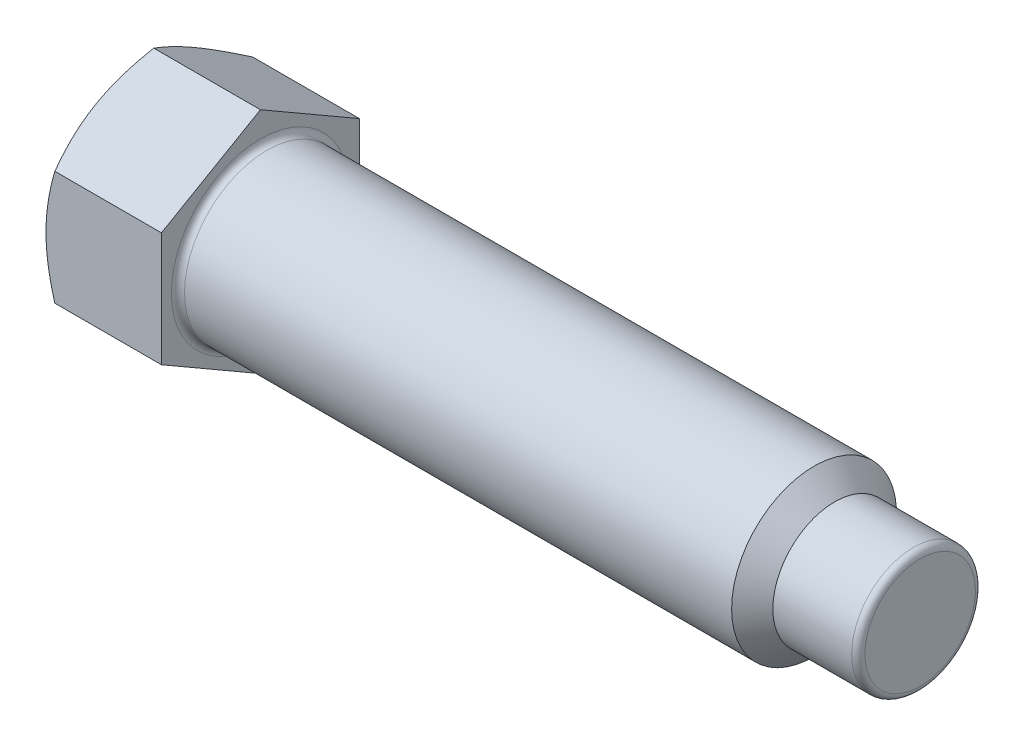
ISO-10303-21;
HEADER;
FILE_DESCRIPTION(('STEP AP214'),'2;1');
FILE_NAME('part.step','',(''),(''),'','','');
FILE_SCHEMA(('AUTOMOTIVE_DESIGN { 1 0 10303 214 1 1 1 1 }'));
ENDSEC;
DATA;
#1=APPLICATION_CONTEXT('core data for automotive mechanical design processes');
#2=APPLICATION_PROTOCOL_DEFINITION('international standard','automotive_design',2000,#1);
#3=PRODUCT_CONTEXT('',#1,'mechanical');
#4=PRODUCT('Part','Part','',(#3));
#5=PRODUCT_RELATED_PRODUCT_CATEGORY('part','',(#4));
#6=PRODUCT_DEFINITION_FORMATION('','',#4);
#7=PRODUCT_DEFINITION_CONTEXT('part definition',#1,'design');
#8=PRODUCT_DEFINITION('design','',#6,#7);
#9=PRODUCT_DEFINITION_SHAPE('','',#8);
#10=(LENGTH_UNIT() NAMED_UNIT(*) SI_UNIT(.MILLI.,.METRE.));
#11=(NAMED_UNIT(*) PLANE_ANGLE_UNIT() SI_UNIT($,.RADIAN.));
#12=(NAMED_UNIT(*) SI_UNIT($,.STERADIAN.) SOLID_ANGLE_UNIT());
#13=UNCERTAINTY_MEASURE_WITH_UNIT(LENGTH_MEASURE(1.E-05),#10,'distance_accuracy_value','');
#14=(GEOMETRIC_REPRESENTATION_CONTEXT(3) GLOBAL_UNCERTAINTY_ASSIGNED_CONTEXT((#13)) GLOBAL_UNIT_ASSIGNED_CONTEXT((#10,
#11,#12)) REPRESENTATION_CONTEXT('',''));
#15=CARTESIAN_POINT('',(0.,0.,0.));
#16=DIRECTION('',(0.,0.,1.));
#17=DIRECTION('',(1.,0.,0.));
#18=AXIS2_PLACEMENT_3D('',#15,#16,#17);
#19=CARTESIAN_POINT('',(14.,6.9282032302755,-12.));
#20=DIRECTION('',(0.,-0.866025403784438,0.500000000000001));
#21=DIRECTION('',(0.,-0.500000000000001,-0.866025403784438));
#22=AXIS2_PLACEMENT_3D('',#19,#20,#21);
#23=PLANE('',#22);
#24=CARTESIAN_POINT('',(1.07186343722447,13.8565219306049,0.0002));
#25=CARTESIAN_POINT('',(0.983949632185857,13.7042251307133,-0.263585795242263));
#26=CARTESIAN_POINT('',(0.900025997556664,13.5513604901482,-0.5283551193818));
#27=CARTESIAN_POINT('',(0.741266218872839,13.244405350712,-1.06001701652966));
#28=CARTESIAN_POINT('',(0.666433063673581,13.0903144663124,-1.32691025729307));
#29=CARTESIAN_POINT('',(0.457017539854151,12.6255589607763,-2.13189040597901));
#30=CARTESIAN_POINT('',(0.33790323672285,12.3130596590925,-2.6731550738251));
#31=CARTESIAN_POINT('',(0.198231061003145,11.8454187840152,-3.48313282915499));
#32=CARTESIAN_POINT('',(0.158443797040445,11.6916742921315,-3.74942610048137));
#33=CARTESIAN_POINT('',(0.091723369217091,11.3834734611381,-4.28324559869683));
#34=CARTESIAN_POINT('',(0.0647904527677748,11.2290171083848,-4.55077184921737));
#35=CARTESIAN_POINT('',(0.0244685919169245,10.9198468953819,-5.08627036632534));
#36=CARTESIAN_POINT('',(0.0110635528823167,10.7651335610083,-5.35424172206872));
#37=CARTESIAN_POINT('',(-0.00191690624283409,10.4555635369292,-5.89043273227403));
#38=CARTESIAN_POINT('',(-0.00149275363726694,10.3007068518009,-6.15865237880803));
#39=CARTESIAN_POINT('',(0.0122200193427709,10.011202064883,-6.6600893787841));
#40=CARTESIAN_POINT('',(0.0238359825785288,9.87653331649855,-6.89334249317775));
#41=CARTESIAN_POINT('',(0.0573080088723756,9.60750555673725,-7.35931224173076));
#42=CARTESIAN_POINT('',(0.0791647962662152,9.47314656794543,-7.59202883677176));
#43=CARTESIAN_POINT('',(0.132737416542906,9.20481134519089,-8.05679907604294));
#44=CARTESIAN_POINT('',(0.16446139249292,9.07083551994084,-8.288852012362));
#45=CARTESIAN_POINT('',(0.237211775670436,8.80351197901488,-8.75186996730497));
#46=CARTESIAN_POINT('',(0.278238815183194,8.67016430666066,-8.98283491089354));
#47=CARTESIAN_POINT('',(0.416311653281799,8.2653799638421,-9.68394195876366));
#48=CARTESIAN_POINT('',(0.52712488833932,7.99511549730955,-10.1520537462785));
#49=CARTESIAN_POINT('',(0.778625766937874,7.45861659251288,-11.0812971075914));
#50=CARTESIAN_POINT('',(0.919254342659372,7.19237528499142,-11.5424405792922));
#51=CARTESIAN_POINT('',(1.07186343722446,6.92808776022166,-12.0002));
#52=B_SPLINE_CURVE_WITH_KNOTS('',3,(#24,#25,#26,#27,#28,#29,#30,#31,#32,#33,#34,#35,#36,#37,#38,
#39,#40,#41,#42,#43,#44,#45,#46,#47,#48,#49,#50,#51),.UNSPECIFIED.,.F.,.F.,(4,2,2,2,2,2,2,2,2,2,
2,2,2,4),(0.,0.951004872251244,1.90232158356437,3.80900466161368,4.7389455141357,
5.66890426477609,6.59775529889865,7.5265776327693,8.33514643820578,9.14377244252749,
9.95306755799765,10.7624176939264,12.4167102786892,14.0677556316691),.UNSPECIFIED.);
#53=CARTESIAN_POINT('',(1.07179676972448,13.856406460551,0.));
#54=VERTEX_POINT('',#53);
#55=CARTESIAN_POINT('',(0.,10.3923048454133,-6.00000000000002));
#56=VERTEX_POINT('',#55);
#57=EDGE_CURVE('E54',#54,#56,#52,.T.);
#58=ORIENTED_EDGE('',*,*,#57,.F.);
#59=DIRECTION('',(-1.,0.,0.));
#60=VECTOR('',#59,1.);
#61=CARTESIAN_POINT('',(14.,13.856406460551,0.));
#62=LINE('',#61,#60);
#63=CARTESIAN_POINT('',(14.,13.856406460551,0.));
#64=VERTEX_POINT('',#63);
#65=EDGE_CURVE('E153',#64,#54,#62,.T.);
#66=ORIENTED_EDGE('',*,*,#65,.F.);
#67=DIRECTION('',(0.,0.500000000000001,0.866025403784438));
#68=VECTOR('',#67,1.);
#69=CARTESIAN_POINT('',(14.,6.9282032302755,-12.));
#70=LINE('',#69,#68);
#71=CARTESIAN_POINT('',(14.,6.9282032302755,-12.));
#72=VERTEX_POINT('',#71);
#73=EDGE_CURVE('E297',#72,#64,#70,.T.);
#74=ORIENTED_EDGE('',*,*,#73,.F.);
#75=DIRECTION('',(-1.,0.,0.));
#76=VECTOR('',#75,1.);
#77=CARTESIAN_POINT('',(14.,6.9282032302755,-12.));
#78=LINE('',#77,#76);
#79=CARTESIAN_POINT('',(1.07179676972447,6.9282032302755,-12.));
#80=VERTEX_POINT('',#79);
#81=EDGE_CURVE('E140',#72,#80,#78,.T.);
#82=ORIENTED_EDGE('',*,*,#81,.T.);
#83=EDGE_CURVE('E134',#56,#80,#52,.T.);
#84=ORIENTED_EDGE('',*,*,#83,.F.);
#85=EDGE_LOOP('',(#58,#66,#74,#82,#84));
#86=FACE_BOUND('',#85,.T.);
#87=ADVANCED_FACE('F39',(#86),#23,.F.);
#88=CARTESIAN_POINT('',(14.,13.856406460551,0.));
#89=DIRECTION('',(0.,-0.866025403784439,-0.5));
#90=DIRECTION('',(0.,0.5,-0.866025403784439));
#91=AXIS2_PLACEMENT_3D('',#88,#89,#90);
#92=PLANE('',#91);
#93=CARTESIAN_POINT('',(1.07186343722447,6.92808776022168,12.0002));
#94=CARTESIAN_POINT('',(0.983949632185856,7.0803845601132,11.7364142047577));
#95=CARTESIAN_POINT('',(0.900025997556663,7.23324920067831,11.4716448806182));
#96=CARTESIAN_POINT('',(0.741266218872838,7.5402043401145,10.9399829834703));
#97=CARTESIAN_POINT('',(0.666433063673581,7.69429522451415,10.6730897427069));
#98=CARTESIAN_POINT('',(0.457017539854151,8.15905073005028,9.86810959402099));
#99=CARTESIAN_POINT('',(0.337903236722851,8.47155003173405,9.3268449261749));
#100=CARTESIAN_POINT('',(0.198231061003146,8.93919090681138,8.51686717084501));
#101=CARTESIAN_POINT('',(0.158443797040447,9.09293539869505,8.25057389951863));
#102=CARTESIAN_POINT('',(0.0917233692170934,9.40113622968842,7.71675440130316));
#103=CARTESIAN_POINT('',(0.0647904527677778,9.55559258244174,7.44922815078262));
#104=CARTESIAN_POINT('',(0.024468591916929,9.86476279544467,6.91372963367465));
#105=CARTESIAN_POINT('',(0.0110635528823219,10.0194761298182,6.64575827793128));
#106=CARTESIAN_POINT('',(-0.00191690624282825,10.3290461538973,6.10956726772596));
#107=CARTESIAN_POINT('',(-0.00149275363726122,10.4839028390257,5.84134762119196));
#108=CARTESIAN_POINT('',(0.0122200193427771,10.7734076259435,5.3399106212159));
#109=CARTESIAN_POINT('',(0.0238359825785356,10.908076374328,5.10665750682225));
#110=CARTESIAN_POINT('',(0.057308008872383,11.1771041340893,4.64068775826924));
#111=CARTESIAN_POINT('',(0.0791647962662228,11.3114631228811,4.40797116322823));
#112=CARTESIAN_POINT('',(0.132737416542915,11.5797983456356,3.94320092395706));
#113=CARTESIAN_POINT('',(0.164461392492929,11.7137741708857,3.711147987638));
#114=CARTESIAN_POINT('',(0.237211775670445,11.9810977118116,3.24813003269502));
#115=CARTESIAN_POINT('',(0.278238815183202,12.1144453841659,3.01716508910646));
#116=CARTESIAN_POINT('',(0.416311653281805,12.5192297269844,2.31605804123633));
#117=CARTESIAN_POINT('',(0.527124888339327,12.789494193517,1.84794625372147));
#118=CARTESIAN_POINT('',(0.778625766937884,13.3259930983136,0.91870289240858));
#119=CARTESIAN_POINT('',(0.919254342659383,13.5922344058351,0.457559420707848));
#120=CARTESIAN_POINT('',(1.07186343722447,13.8565219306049,-0.000199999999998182));
#121=B_SPLINE_CURVE_WITH_KNOTS('',3,(#93,#94,#95,#96,#97,#98,#99,#100,#101,#102,#103,#104,#105,
#106,#107,#108,#109,#110,#111,#112,#113,#114,#115,#116,#117,#118,#119,#120),.UNSPECIFIED.,.F.,
.F.,(4,2,2,2,2,2,2,2,2,2,2,2,2,4),(0.,0.951004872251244,1.90232158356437,3.80900466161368,
4.7389455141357,5.66890426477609,6.59775529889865,7.5265776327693,8.33514643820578,
9.14377244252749,9.95306755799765,10.7624176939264,12.4167102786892,14.0677556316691),.UNSPECIFIED.);
#122=CARTESIAN_POINT('',(1.07179676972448,6.92820323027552,12.));
#123=VERTEX_POINT('',#122);
#124=CARTESIAN_POINT('',(0.,10.3923048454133,6.));
#125=VERTEX_POINT('',#124);
#126=EDGE_CURVE('E62',#123,#125,#121,.T.);
#127=ORIENTED_EDGE('',*,*,#126,.F.);
#128=DIRECTION('',(-1.,0.,0.));
#129=VECTOR('',#128,1.);
#130=CARTESIAN_POINT('',(14.,6.92820323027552,12.));
#131=LINE('',#130,#129);
#132=CARTESIAN_POINT('',(14.,6.92820323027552,12.));
#133=VERTEX_POINT('',#132);
#134=EDGE_CURVE('E150',#133,#123,#131,.T.);
#135=ORIENTED_EDGE('',*,*,#134,.F.);
#136=DIRECTION('',(0.,-0.5,0.866025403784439));
#137=VECTOR('',#136,1.);
#138=CARTESIAN_POINT('',(14.,13.856406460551,0.));
#139=LINE('',#138,#137);
#140=EDGE_CURVE('E299',#64,#133,#139,.T.);
#141=ORIENTED_EDGE('',*,*,#140,.F.);
#142=ORIENTED_EDGE('',*,*,#65,.T.);
#143=EDGE_CURVE('E234',#125,#54,#121,.T.);
#144=ORIENTED_EDGE('',*,*,#143,.F.);
#145=EDGE_LOOP('',(#127,#135,#141,#142,#144));
#146=FACE_BOUND('',#145,.T.);
#147=ADVANCED_FACE('F181',(#146),#92,.F.);
#148=CARTESIAN_POINT('',(14.,6.92820323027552,12.));
#149=DIRECTION('',(0.,0.,-1.));
#150=DIRECTION('',(-1.,0.,0.));
#151=AXIS2_PLACEMENT_3D('',#148,#149,#150);
#152=PLANE('',#151);
#153=CARTESIAN_POINT('',(5.93796522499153,-18.7780422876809,12.));
#154=CARTESIAN_POINT('',(5.81013580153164,-18.5152821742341,12.));
#155=CARTESIAN_POINT('',(5.68293119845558,-18.2522182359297,12.));
#156=CARTESIAN_POINT('',(5.4299128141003,-17.7254193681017,12.));
#157=CARTESIAN_POINT('',(5.30409904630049,-17.4616844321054,12.));
#158=CARTESIAN_POINT('',(4.92892368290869,-16.6693101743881,12.));
#159=CARTESIAN_POINT('',(4.68186469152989,-16.1395765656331,12.));
#160=CARTESIAN_POINT('',(4.19405479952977,-15.0738169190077,12.));
#161=CARTESIAN_POINT('',(3.95334413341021,-14.5377724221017,12.));
#162=CARTESIAN_POINT('',(3.48154718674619,-13.461479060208,12.));
#163=CARTESIAN_POINT('',(3.25046046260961,-12.9212303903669,12.));
#164=CARTESIAN_POINT('',(2.79294900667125,-11.8175688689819,12.));
#165=CARTESIAN_POINT('',(2.56693655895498,-11.2539842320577,12.));
#166=CARTESIAN_POINT('',(2.1316128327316,-10.1202797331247,12.));
#167=CARTESIAN_POINT('',(1.92230340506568,-9.55015915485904,12.));
#168=CARTESIAN_POINT('',(1.52576124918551,-8.40350794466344,12.));
#169=CARTESIAN_POINT('',(1.33848523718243,-7.82699240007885,12.));
#170=CARTESIAN_POINT('',(0.991896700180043,-6.66563869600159,12.));
#171=CARTESIAN_POINT('',(0.832575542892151,-6.08080316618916,12.));
#172=CARTESIAN_POINT('',(0.620681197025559,-5.19882791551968,12.));
#173=CARTESIAN_POINT('',(0.554713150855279,-4.90488790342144,12.));
#174=CARTESIAN_POINT('',(0.432574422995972,-4.31496880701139,12.));
#175=CARTESIAN_POINT('',(0.376403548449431,-4.01898976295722,12.));
#176=CARTESIAN_POINT('',(0.274840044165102,-3.42518449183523,12.));
#177=CARTESIAN_POINT('',(0.229447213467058,-3.12735829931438,12.));
#178=CARTESIAN_POINT('',(0.150338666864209,-2.5301603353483,12.));
#179=CARTESIAN_POINT('',(0.116622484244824,-2.23078862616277,12.));
#180=CARTESIAN_POINT('',(0.0619693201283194,-1.63489952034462,12.));
#181=CARTESIAN_POINT('',(0.0408679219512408,-1.33839729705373,12.));
#182=CARTESIAN_POINT('',(0.011231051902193,-0.744766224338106,12.));
#183=CARTESIAN_POINT('',(0.00269536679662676,-0.447637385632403,12.));
#184=CARTESIAN_POINT('',(-0.00160621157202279,0.146715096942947,12.));
#185=CARTESIAN_POINT('',(0.00262788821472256,0.443938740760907,12.));
#186=CARTESIAN_POINT('',(0.0237602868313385,1.03793867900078,12.));
#187=CARTESIAN_POINT('',(0.0406591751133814,1.33471495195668,12.));
#188=CARTESIAN_POINT('',(0.0957363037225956,2.04293812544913,12.));
#189=CARTESIAN_POINT('',(0.139644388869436,2.45394931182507,12.));
#190=CARTESIAN_POINT('',(0.249393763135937,3.27301119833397,12.));
#191=CARTESIAN_POINT('',(0.315237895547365,3.68106150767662,12.));
#192=CARTESIAN_POINT('',(0.542190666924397,4.90025554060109,12.));
#193=CARTESIAN_POINT('',(0.732681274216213,5.70600726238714,12.));
#194=CARTESIAN_POINT('',(1.06415793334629,6.9110176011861,12.));
#195=CARTESIAN_POINT('',(1.18384338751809,7.31649624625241,12.));
#196=CARTESIAN_POINT('',(1.43593551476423,8.12351840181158,12.));
#197=CARTESIAN_POINT('',(1.56834227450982,8.52506188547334,12.));
#198=CARTESIAN_POINT('',(1.84372865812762,9.32433402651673,12.));
#199=CARTESIAN_POINT('',(1.98670500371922,9.72206382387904,12.));
#200=CARTESIAN_POINT('',(2.28151949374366,10.514209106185,12.));
#201=CARTESIAN_POINT('',(2.43335751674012,10.9086246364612,12.));
#202=CARTESIAN_POINT('',(2.81137815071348,11.8636440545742,12.));
#203=CARTESIAN_POINT('',(3.04143185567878,12.4227131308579,12.));
#204=CARTESIAN_POINT('',(3.51333410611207,13.5358669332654,12.));
#205=CARTESIAN_POINT('',(3.75518348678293,14.0899513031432,12.));
#206=CARTESIAN_POINT('',(4.24823475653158,15.1941025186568,12.));
#207=CARTESIAN_POINT('',(4.49943904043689,15.7441682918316,12.));
#208=CARTESIAN_POINT('',(5.00924552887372,16.840834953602,12.));
#209=CARTESIAN_POINT('',(5.26784754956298,17.38743592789,12.));
#210=CARTESIAN_POINT('',(5.79133879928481,18.4784293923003,12.));
#211=CARTESIAN_POINT('',(6.05623527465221,19.0228183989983,12.));
#212=CARTESIAN_POINT('',(6.59090796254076,20.1091945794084,12.));
#213=CARTESIAN_POINT('',(6.86068419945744,20.651181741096,12.));
#214=CARTESIAN_POINT('',(7.40421496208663,21.7330545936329,12.));
#215=CARTESIAN_POINT('',(7.67796889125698,22.2729405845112,12.));
#216=CARTESIAN_POINT('',(8.22882461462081,23.351002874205,12.));
#217=CARTESIAN_POINT('',(8.50592642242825,23.8891791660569,12.));
#218=CARTESIAN_POINT('',(9.29226596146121,25.4066579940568,12.));
#219=CARTESIAN_POINT('',(9.8047565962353,26.3842748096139,12.));
#220=CARTESIAN_POINT('',(10.8366490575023,28.3358962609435,12.));
#221=CARTESIAN_POINT('',(11.3560511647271,29.3099007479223,12.));
#222=CARTESIAN_POINT('',(12.3986980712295,31.2524398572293,12.));
#223=CARTESIAN_POINT('',(12.9219285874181,32.2209821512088,12.));
#224=CARTESIAN_POINT('',(13.709817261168,33.6721037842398,12.));
#225=CARTESIAN_POINT('',(13.9729461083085,34.1555146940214,12.));
#226=CARTESIAN_POINT('',(14.5001155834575,35.1218381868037,12.));
#227=CARTESIAN_POINT('',(14.7641562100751,35.6047507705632,12.));
#228=CARTESIAN_POINT('',(15.0285993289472,36.087442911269,12.));
#229=B_SPLINE_CURVE_WITH_KNOTS('',3,(#153,#154,#155,#156,#157,#158,#159,#160,#161,#162,#163,
#164,#165,#166,#167,#168,#169,#170,#171,#172,#173,#174,#175,#176,#177,#178,#179,#180,#181,#182,
#183,#184,#185,#186,#187,#188,#189,#190,#191,#192,#193,#194,#195,#196,#197,#198,#199,#200,#201,
#202,#203,#204,#205,#206,#207,#208,#209,#210,#211,#212,#213,#214,#215,#216,#217,#218,#219,#220,
#221,#222,#223,#224,#225,#226,#227,#228),.UNSPECIFIED.,.F.,.F.,(4,2,2,2,2,2,2,2,2,2,2,2,2,2,2,2,
2,2,2,2,2,2,2,2,2,2,2,2,2,2,2,2,2,2,2,2,2,4),(0.,0.876610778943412,1.75323004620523,
3.50671945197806,5.26947518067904,7.03214956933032,8.85359042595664,10.6752328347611,
12.4932347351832,14.3106742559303,15.2142921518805,16.117892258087,17.0214755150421,
17.9250226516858,18.8165208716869,19.7080039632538,20.5994865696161,21.4910106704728,
22.7303633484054,23.9698767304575,26.4502079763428,27.7184187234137,28.9866381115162,
30.2544657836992,31.5222760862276,33.3357454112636,35.1493433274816,36.9634087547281,
38.7774291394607,40.5936500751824,42.4098800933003,44.2258404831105,46.0418082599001,
49.3531754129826,52.664677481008,55.9671781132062,57.6183303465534,59.2694800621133),.UNSPECIFIED.);
#230=CARTESIAN_POINT('',(1.07179676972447,-6.92820323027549,12.));
#231=VERTEX_POINT('',#230);
#232=CARTESIAN_POINT('',(0.,0.,12.));
#233=VERTEX_POINT('',#232);
#234=EDGE_CURVE('E245',#231,#233,#229,.T.);
#235=ORIENTED_EDGE('',*,*,#234,.F.);
#236=DIRECTION('',(-1.,0.,0.));
#237=VECTOR('',#236,1.);
#238=CARTESIAN_POINT('',(14.,-6.92820323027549,12.));
#239=LINE('',#238,#237);
#240=CARTESIAN_POINT('',(14.,-6.92820323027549,12.));
#241=VERTEX_POINT('',#240);
#242=EDGE_CURVE('E142',#241,#231,#239,.T.);
#243=ORIENTED_EDGE('',*,*,#242,.F.);
#244=DIRECTION('',(0.,-1.,0.));
#245=VECTOR('',#244,1.);
#246=CARTESIAN_POINT('',(14.,6.92820323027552,12.));
#247=LINE('',#246,#245);
#248=EDGE_CURVE('E302',#133,#241,#247,.T.);
#249=ORIENTED_EDGE('',*,*,#248,.F.);
#250=ORIENTED_EDGE('',*,*,#134,.T.);
#251=EDGE_CURVE('E239',#233,#123,#229,.T.);
#252=ORIENTED_EDGE('',*,*,#251,.F.);
#253=EDGE_LOOP('',(#235,#243,#249,#250,#252));
#254=FACE_BOUND('',#253,.T.);
#255=ADVANCED_FACE('F188',(#254),#152,.F.);
#256=CARTESIAN_POINT('',(14.,-13.856406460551,0.));
#257=DIRECTION('',(0.,0.866025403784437,-0.500000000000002));
#258=DIRECTION('',(0.,0.500000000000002,0.866025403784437));
#259=AXIS2_PLACEMENT_3D('',#256,#257,#258);
#260=PLANE('',#259);
#261=CARTESIAN_POINT('',(1.07186343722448,-13.8565219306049,-0.000200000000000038));
#262=CARTESIAN_POINT('',(0.983949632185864,-13.7042251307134,0.263585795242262));
#263=CARTESIAN_POINT('',(0.900025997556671,-13.5513604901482,0.528355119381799));
#264=CARTESIAN_POINT('',(0.741266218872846,-13.2444053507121,1.06001701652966));
#265=CARTESIAN_POINT('',(0.666433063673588,-13.0903144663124,1.32691025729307));
#266=CARTESIAN_POINT('',(0.457017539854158,-12.6255589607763,2.13189040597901));
#267=CARTESIAN_POINT('',(0.337903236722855,-12.3130596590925,2.6731550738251));
#268=CARTESIAN_POINT('',(0.198231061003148,-11.8454187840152,3.48313282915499));
#269=CARTESIAN_POINT('',(0.158443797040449,-11.6916742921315,3.74942610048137));
#270=CARTESIAN_POINT('',(0.0917233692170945,-11.3834734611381,4.28324559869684));
#271=CARTESIAN_POINT('',(0.0647904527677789,-11.2290171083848,4.55077184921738));
#272=CARTESIAN_POINT('',(0.0244685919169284,-10.9198468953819,5.08627036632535));
#273=CARTESIAN_POINT('',(0.0110635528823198,-10.7651335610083,5.35424172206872));
#274=CARTESIAN_POINT('',(-0.00191690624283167,-10.4555635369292,5.89043273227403));
#275=CARTESIAN_POINT('',(-0.0014927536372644,-10.3007068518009,6.15865237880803));
#276=CARTESIAN_POINT('',(0.0122200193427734,-10.0112020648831,6.6600893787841));
#277=CARTESIAN_POINT('',(0.0238359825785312,-9.87653331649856,6.89334249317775));
#278=CARTESIAN_POINT('',(0.0573080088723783,-9.60750555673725,7.35931224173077));
#279=CARTESIAN_POINT('',(0.0791647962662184,-9.47314656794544,7.59202883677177));
#280=CARTESIAN_POINT('',(0.132737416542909,-9.2048113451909,8.05679907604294));
#281=CARTESIAN_POINT('',(0.164461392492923,-9.07083551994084,8.288852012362));
#282=CARTESIAN_POINT('',(0.237211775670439,-8.80351197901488,8.75186996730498));
#283=CARTESIAN_POINT('',(0.278238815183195,-8.67016430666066,8.98283491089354));
#284=CARTESIAN_POINT('',(0.416311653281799,-8.2653799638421,9.68394195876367));
#285=CARTESIAN_POINT('',(0.52712488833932,-7.99511549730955,10.1520537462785));
#286=CARTESIAN_POINT('',(0.778625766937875,-7.45861659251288,11.0812971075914));
#287=CARTESIAN_POINT('',(0.919254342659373,-7.19237528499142,11.5424405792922));
#288=CARTESIAN_POINT('',(1.07186343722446,-6.92808776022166,12.0002));
#289=B_SPLINE_CURVE_WITH_KNOTS('',3,(#261,#262,#263,#264,#265,#266,#267,#268,#269,#270,#271,
#272,#273,#274,#275,#276,#277,#278,#279,#280,#281,#282,#283,#284,#285,#286,#287,#288),
.UNSPECIFIED.,.F.,.F.,(4,2,2,2,2,2,2,2,2,2,2,2,2,4),(0.,0.951004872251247,1.90232158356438,
3.80900466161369,4.7389455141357,5.66890426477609,6.59775529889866,7.52657763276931,
8.33514643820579,9.1437724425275,9.95306755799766,10.7624176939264,12.4167102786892,
14.0677556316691),.UNSPECIFIED.);
#290=CARTESIAN_POINT('',(1.07179676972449,-13.856406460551,0.));
#291=VERTEX_POINT('',#290);
#292=CARTESIAN_POINT('',(0.,-10.3923048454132,6.00000000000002));
#293=VERTEX_POINT('',#292);
#294=EDGE_CURVE('E206',#291,#293,#289,.T.);
#295=ORIENTED_EDGE('',*,*,#294,.F.);
#296=DIRECTION('',(-1.,0.,0.));
#297=VECTOR('',#296,1.);
#298=CARTESIAN_POINT('',(14.,-13.856406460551,0.));
#299=LINE('',#298,#297);
#300=CARTESIAN_POINT('',(14.,-13.856406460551,0.));
#301=VERTEX_POINT('',#300);
#302=EDGE_CURVE('E139',#301,#291,#299,.T.);
#303=ORIENTED_EDGE('',*,*,#302,.F.);
#304=DIRECTION('',(0.,-0.500000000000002,-0.866025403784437));
#305=VECTOR('',#304,1.);
#306=CARTESIAN_POINT('',(14.,-13.856406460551,0.));
#307=LINE('',#306,#305);
#308=EDGE_CURVE('E307',#241,#301,#307,.T.);
#309=ORIENTED_EDGE('',*,*,#308,.F.);
#310=ORIENTED_EDGE('',*,*,#242,.T.);
#311=EDGE_CURVE('E246',#293,#231,#289,.T.);
#312=ORIENTED_EDGE('',*,*,#311,.F.);
#313=EDGE_LOOP('',(#295,#303,#309,#310,#312));
#314=FACE_BOUND('',#313,.T.);
#315=ADVANCED_FACE('F251',(#314),#260,.F.);
#316=CARTESIAN_POINT('',(14.,-6.92820323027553,-12.));
#317=DIRECTION('',(0.,0.866025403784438,0.5));
#318=DIRECTION('',(0.,-0.5,0.866025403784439));
#319=AXIS2_PLACEMENT_3D('',#316,#317,#318);
#320=PLANE('',#319);
#321=CARTESIAN_POINT('',(1.07186343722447,-6.92808776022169,-12.0002));
#322=CARTESIAN_POINT('',(0.983949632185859,-7.08038456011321,-11.7364142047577));
#323=CARTESIAN_POINT('',(0.900025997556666,-7.23324920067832,-11.4716448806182));
#324=CARTESIAN_POINT('',(0.741266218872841,-7.54020434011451,-10.9399829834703));
#325=CARTESIAN_POINT('',(0.666433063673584,-7.69429522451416,-10.6730897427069));
#326=CARTESIAN_POINT('',(0.457017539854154,-8.15905073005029,-9.86810959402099));
#327=CARTESIAN_POINT('',(0.337903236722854,-8.47155003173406,-9.3268449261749));
#328=CARTESIAN_POINT('',(0.198231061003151,-8.93919090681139,-8.516867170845));
#329=CARTESIAN_POINT('',(0.158443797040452,-9.09293539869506,-8.25057389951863));
#330=CARTESIAN_POINT('',(0.0917233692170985,-9.40113622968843,-7.71675440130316));
#331=CARTESIAN_POINT('',(0.0647904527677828,-9.55559258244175,-7.44922815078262));
#332=CARTESIAN_POINT('',(0.024468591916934,-9.86476279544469,-6.91372963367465));
#333=CARTESIAN_POINT('',(0.011063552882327,-10.0194761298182,-6.64575827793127));
#334=CARTESIAN_POINT('',(-0.00191690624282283,-10.3290461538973,-6.10956726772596));
#335=CARTESIAN_POINT('',(-0.00149275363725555,-10.4839028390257,-5.84134762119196));
#336=CARTESIAN_POINT('',(0.0122200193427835,-10.7734076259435,-5.3399106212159));
#337=CARTESIAN_POINT('',(0.0238359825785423,-10.908076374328,-5.10665750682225));
#338=CARTESIAN_POINT('',(0.0573080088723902,-11.1771041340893,-4.64068775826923));
#339=CARTESIAN_POINT('',(0.07916479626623,-11.3114631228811,-4.40797116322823));
#340=CARTESIAN_POINT('',(0.132737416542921,-11.5797983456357,-3.94320092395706));
#341=CARTESIAN_POINT('',(0.164461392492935,-11.7137741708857,-3.711147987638));
#342=CARTESIAN_POINT('',(0.237211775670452,-11.9810977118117,-3.24813003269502));
#343=CARTESIAN_POINT('',(0.278238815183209,-12.1144453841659,-3.01716508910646));
#344=CARTESIAN_POINT('',(0.416311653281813,-12.5192297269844,-2.31605804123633));
#345=CARTESIAN_POINT('',(0.527124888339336,-12.789494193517,-1.84794625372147));
#346=CARTESIAN_POINT('',(0.778625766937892,-13.3259930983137,-0.918702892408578));
#347=CARTESIAN_POINT('',(0.91925434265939,-13.5922344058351,-0.457559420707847));
#348=CARTESIAN_POINT('',(1.07186343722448,-13.8565219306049,0.000199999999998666));
#349=B_SPLINE_CURVE_WITH_KNOTS('',3,(#321,#322,#323,#324,#325,#326,#327,#328,#329,#330,#331,
#332,#333,#334,#335,#336,#337,#338,#339,#340,#341,#342,#343,#344,#345,#346,#347,#348),
.UNSPECIFIED.,.F.,.F.,(4,2,2,2,2,2,2,2,2,2,2,2,2,4),(0.,0.951004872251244,1.90232158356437,
3.80900466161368,4.7389455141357,5.66890426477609,6.59775529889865,7.5265776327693,
8.33514643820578,9.14377244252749,9.95306755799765,10.7624176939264,12.4167102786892,
14.0677556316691),.UNSPECIFIED.);
#350=CARTESIAN_POINT('',(1.07179676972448,-6.92820323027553,-12.));
#351=VERTEX_POINT('',#350);
#352=CARTESIAN_POINT('',(0.,-10.3923048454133,-6.));
#353=VERTEX_POINT('',#352);
#354=EDGE_CURVE('E115',#351,#353,#349,.T.);
#355=ORIENTED_EDGE('',*,*,#354,.F.);
#356=DIRECTION('',(-1.,0.,0.));
#357=VECTOR('',#356,1.);
#358=CARTESIAN_POINT('',(14.,-6.92820323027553,-12.));
#359=LINE('',#358,#357);
#360=CARTESIAN_POINT('',(14.,-6.92820323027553,-12.));
#361=VERTEX_POINT('',#360);
#362=EDGE_CURVE('E130',#361,#351,#359,.T.);
#363=ORIENTED_EDGE('',*,*,#362,.F.);
#364=DIRECTION('',(0.,0.5,-0.866025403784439));
#365=VECTOR('',#364,1.);
#366=CARTESIAN_POINT('',(14.,-6.92820323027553,-12.));
#367=LINE('',#366,#365);
#368=EDGE_CURVE('E309',#301,#361,#367,.T.);
#369=ORIENTED_EDGE('',*,*,#368,.F.);
#370=ORIENTED_EDGE('',*,*,#302,.T.);
#371=EDGE_CURVE('E133',#353,#291,#349,.T.);
#372=ORIENTED_EDGE('',*,*,#371,.F.);
#373=EDGE_LOOP('',(#355,#363,#369,#370,#372));
#374=FACE_BOUND('',#373,.T.);
#375=ADVANCED_FACE('F128',(#374),#320,.F.);
#376=CARTESIAN_POINT('',(14.,6.9282032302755,-12.));
#377=DIRECTION('',(0.,0.,1.));
#378=DIRECTION('',(0.,-1.,0.));
#379=AXIS2_PLACEMENT_3D('',#376,#377,#378);
#380=PLANE('',#379);
#381=CARTESIAN_POINT('',(5.93796522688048,-18.7780422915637,-12.));
#382=CARTESIAN_POINT('',(5.81013580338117,-18.5152821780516,-12.));
#383=CARTESIAN_POINT('',(5.68293120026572,-18.2522182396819,-12.));
#384=CARTESIAN_POINT('',(5.42991281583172,-17.7254193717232,-12.));
#385=CARTESIAN_POINT('',(5.30409904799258,-17.4616844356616,-12.));
#386=CARTESIAN_POINT('',(4.92892368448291,-16.669310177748,-12.));
#387=CARTESIAN_POINT('',(4.68186469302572,-16.139576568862,-12.));
#388=CARTESIAN_POINT('',(4.19405480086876,-15.0738169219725,-12.));
#389=CARTESIAN_POINT('',(3.95334413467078,-14.5377724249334,-12.));
#390=CARTESIAN_POINT('',(3.48154718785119,-13.4614790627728,-12.));
#391=CARTESIAN_POINT('',(3.25046046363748,-12.9212303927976,-12.));
#392=CARTESIAN_POINT('',(2.7929490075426,-11.8175688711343,-12.));
#393=CARTESIAN_POINT('',(2.56693655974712,-11.2539842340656,-12.));
#394=CARTESIAN_POINT('',(2.13161283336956,-10.1202797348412,-12.));
#395=CARTESIAN_POINT('',(1.92230340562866,-9.55015915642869,-12.));
#396=CARTESIAN_POINT('',(1.52576124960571,-8.40350794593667,-12.));
#397=CARTESIAN_POINT('',(1.33848523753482,-7.82699240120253,-12.));
#398=CARTESIAN_POINT('',(0.991896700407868,-6.66563869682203,-12.));
#399=CARTESIAN_POINT('',(0.83257554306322,-6.08080316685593,-12.));
#400=CARTESIAN_POINT('',(0.620681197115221,-5.19882791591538,-12.));
#401=CARTESIAN_POINT('',(0.554713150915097,-4.90488790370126,-12.));
#402=CARTESIAN_POINT('',(0.432574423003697,-4.3149688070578,-12.));
#403=CARTESIAN_POINT('',(0.376403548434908,-4.01898976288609,-12.));
#404=CARTESIAN_POINT('',(0.274840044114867,-3.42518449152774,-12.));
#405=CARTESIAN_POINT('',(0.229447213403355,-3.12735829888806,-12.));
#406=CARTESIAN_POINT('',(0.150338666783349,-2.53016033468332,-12.));
#407=CARTESIAN_POINT('',(0.116622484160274,-2.23078862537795,-12.));
#408=CARTESIAN_POINT('',(0.0619693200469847,-1.63489951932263,-12.));
#409=CARTESIAN_POINT('',(0.040867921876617,-1.33839729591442,-12.));
#410=CARTESIAN_POINT('',(0.0112310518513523,-0.744766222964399,-12.));
#411=CARTESIAN_POINT('',(0.00269536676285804,-0.447637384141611,-12.));
#412=CARTESIAN_POINT('',(-0.00160621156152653,0.146715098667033,-12.));
#413=CARTESIAN_POINT('',(0.00262788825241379,0.443938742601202,-12.));
#414=CARTESIAN_POINT('',(0.0237602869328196,1.03793868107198,-12.));
#415=CARTESIAN_POINT('',(0.0406591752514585,1.33471495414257,-12.));
#416=CARTESIAN_POINT('',(0.0957363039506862,2.04293812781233,-12.));
#417=CARTESIAN_POINT('',(0.139644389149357,2.45394931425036,-12.));
#418=CARTESIAN_POINT('',(0.249393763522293,3.27301120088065,-12.));
#419=CARTESIAN_POINT('',(0.315237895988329,3.68106151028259,-12.));
#420=CARTESIAN_POINT('',(0.542190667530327,4.90025554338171,-12.));
#421=CARTESIAN_POINT('',(0.732681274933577,5.70600726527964,-12.));
#422=CARTESIAN_POINT('',(1.06415793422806,6.91101760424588,-12.));
#423=CARTESIAN_POINT('',(1.18384338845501,7.3164962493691,-12.));
#424=CARTESIAN_POINT('',(1.43593551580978,8.12351840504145,-12.));
#425=CARTESIAN_POINT('',(1.56834227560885,8.52506188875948,-12.));
#426=CARTESIAN_POINT('',(1.8437286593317,9.32433402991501,-12.));
#427=CARTESIAN_POINT('',(1.98670500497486,9.72206382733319,-12.));
#428=CARTESIAN_POINT('',(2.28151949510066,10.5142091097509,-12.));
#429=CARTESIAN_POINT('',(2.43335751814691,10.9086246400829,-12.));
#430=CARTESIAN_POINT('',(2.81137815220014,11.863644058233,-12.));
#431=CARTESIAN_POINT('',(3.04143185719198,12.422713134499,-12.));
#432=CARTESIAN_POINT('',(3.51333410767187,13.5358669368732,-12.));
#433=CARTESIAN_POINT('',(3.7551834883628,14.0899513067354,-12.));
#434=CARTESIAN_POINT('',(4.24823475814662,15.1941025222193,-12.));
#435=CARTESIAN_POINT('',(4.49943904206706,15.7441682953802,-12.));
#436=CARTESIAN_POINT('',(5.00924553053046,16.8408349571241,-12.));
#437=CARTESIAN_POINT('',(5.26784755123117,17.3874359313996,-12.));
#438=CARTESIAN_POINT('',(5.79133880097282,18.4784293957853,-12.));
#439=CARTESIAN_POINT('',(6.05623527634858,19.0228184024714,-12.));
#440=CARTESIAN_POINT('',(6.59090796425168,20.1091945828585,-12.));
#441=CARTESIAN_POINT('',(6.86068420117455,20.6511817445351,-12.));
#442=CARTESIAN_POINT('',(7.40421496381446,21.7330545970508,-12.));
#443=CARTESIAN_POINT('',(7.67796889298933,22.2729405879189,-12.));
#444=CARTESIAN_POINT('',(8.2288246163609,23.3510028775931,-12.));
#445=CARTESIAN_POINT('',(8.50592642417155,23.8891791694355,-12.));
#446=CARTESIAN_POINT('',(9.29226596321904,25.4066579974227,-12.));
#447=CARTESIAN_POINT('',(9.80475659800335,26.3842748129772,-12.));
#448=CARTESIAN_POINT('',(10.8366490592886,28.3358962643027,-12.));
#449=CARTESIAN_POINT('',(11.3560511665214,29.3099007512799,-12.));
#450=CARTESIAN_POINT('',(12.3986980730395,31.252439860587,-12.));
#451=CARTESIAN_POINT('',(12.9219285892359,32.2209821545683,-12.));
#452=CARTESIAN_POINT('',(13.7098172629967,33.6721037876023,-12.));
#453=CARTESIAN_POINT('',(13.9729461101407,34.155514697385,-12.));
#454=CARTESIAN_POINT('',(14.5001155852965,35.1218381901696,-12.));
#455=CARTESIAN_POINT('',(14.7641562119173,35.6047507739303,-12.));
#456=CARTESIAN_POINT('',(15.0285993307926,36.0874429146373,-12.));
#457=B_SPLINE_CURVE_WITH_KNOTS('',3,(#381,#382,#383,#384,#385,#386,#387,#388,#389,#390,#391,
#392,#393,#394,#395,#396,#397,#398,#399,#400,#401,#402,#403,#404,#405,#406,#407,#408,#409,#410,
#411,#412,#413,#414,#415,#416,#417,#418,#419,#420,#421,#422,#423,#424,#425,#426,#427,#428,#429,
#430,#431,#432,#433,#434,#435,#436,#437,#438,#439,#440,#441,#442,#443,#444,#445,#446,#447,#448,
#449,#450,#451,#452,#453,#454,#455,#456),.UNSPECIFIED.,.F.,.F.,(4,2,2,2,2,2,2,2,2,2,2,2,2,2,2,2,
2,2,2,2,2,2,2,2,2,2,2,2,2,2,2,2,2,2,2,2,2,4),(0.,0.876610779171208,1.75323004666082,
3.50671945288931,5.26947518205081,7.03214957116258,8.85359042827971,10.6752328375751,
12.4932347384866,14.3106742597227,15.2142921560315,16.1178922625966,17.02147551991,
17.9250226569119,18.8165208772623,19.7080039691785,20.5994865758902,21.4910106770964,
22.7303633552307,23.9698767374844,26.4502079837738,27.7184187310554,28.9866381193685,
30.2544657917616,31.5222760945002,33.3357454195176,35.1493433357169,36.9634087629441,
38.7774291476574,40.5936500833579,42.4098801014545,44.2258404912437,46.0418082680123,
49.3531754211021,52.6646774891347,55.9671781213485,57.6183303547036,59.2694800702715),.UNSPECIFIED.);
#458=CARTESIAN_POINT('',(0.,0.,-12.));
#459=VERTEX_POINT('',#458);
#460=EDGE_CURVE('E122',#80,#459,#457,.F.);
#461=ORIENTED_EDGE('',*,*,#460,.F.);
#462=ORIENTED_EDGE('',*,*,#81,.F.);
#463=DIRECTION('',(0.,1.,0.));
#464=VECTOR('',#463,1.);
#465=CARTESIAN_POINT('',(14.,6.9282032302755,-12.));
#466=LINE('',#465,#464);
#467=EDGE_CURVE('E138',#361,#72,#466,.T.);
#468=ORIENTED_EDGE('',*,*,#467,.F.);
#469=ORIENTED_EDGE('',*,*,#362,.T.);
#470=EDGE_CURVE('E112',#459,#351,#457,.F.);
#471=ORIENTED_EDGE('',*,*,#470,.F.);
#472=EDGE_LOOP('',(#461,#462,#468,#469,#471));
#473=FACE_BOUND('',#472,.T.);
#474=ADVANCED_FACE('F136',(#473),#380,.F.);
#475=CARTESIAN_POINT('',(14.,0.,-24.));
#476=DIRECTION('',(1.,0.,0.));
#477=DIRECTION('',(0.,0.,-1.));
#478=AXIS2_PLACEMENT_3D('',#475,#476,#477);
#479=PLANE('',#478);
#480=CARTESIAN_POINT('',(14.,0.,0.));
#481=DIRECTION('',(1.,0.,0.));
#482=DIRECTION('',(0.,0.,-1.));
#483=AXIS2_PLACEMENT_3D('',#480,#481,#482);
#484=CIRCLE('',#483,10.8);
#485=CARTESIAN_POINT('',(14.,0.,-10.8));
#486=VERTEX_POINT('',#485);
#487=EDGE_CURVE('E159',#486,#486,#484,.F.);
#488=ORIENTED_EDGE('',*,*,#487,.T.);
#489=EDGE_LOOP('',(#488));
#490=FACE_BOUND('',#489,.T.);
#491=ORIENTED_EDGE('',*,*,#73,.T.);
#492=ORIENTED_EDGE('',*,*,#140,.T.);
#493=ORIENTED_EDGE('',*,*,#248,.T.);
#494=ORIENTED_EDGE('',*,*,#308,.T.);
#495=ORIENTED_EDGE('',*,*,#368,.T.);
#496=ORIENTED_EDGE('',*,*,#467,.T.);
#497=EDGE_LOOP('',(#491,#492,#493,#494,#495,#496));
#498=FACE_BOUND('',#497,.T.);
#499=ADVANCED_FACE('F261',(#490,#498),#479,.T.);
#500=CARTESIAN_POINT('',(0.,0.,0.));
#501=DIRECTION('',(-1.,0.,0.));
#502=DIRECTION('',(0.,0.,1.));
#503=AXIS2_PLACEMENT_3D('',#500,#501,#502);
#504=CYLINDRICAL_SURFACE('',#503,10.);
#505=CARTESIAN_POINT('',(14.8,0.,0.));
#506=DIRECTION('',(1.,0.,0.));
#507=DIRECTION('',(0.,0.,-1.));
#508=AXIS2_PLACEMENT_3D('',#505,#506,#507);
#509=CIRCLE('',#508,10.);
#510=CARTESIAN_POINT('',(14.8,0.,-10.));
#511=VERTEX_POINT('',#510);
#512=EDGE_CURVE('E162',#511,#511,#509,.T.);
#513=ORIENTED_EDGE('',*,*,#512,.T.);
#514=EDGE_LOOP('',(#513));
#515=FACE_BOUND('',#514,.T.);
#516=CARTESIAN_POINT('',(81.14,0.,0.));
#517=DIRECTION('',(-1.,0.,0.));
#518=DIRECTION('',(0.,0.,1.));
#519=AXIS2_PLACEMENT_3D('',#516,#517,#518);
#520=CIRCLE('',#519,10.);
#521=CARTESIAN_POINT('',(81.14,0.,10.));
#522=VERTEX_POINT('',#521);
#523=EDGE_CURVE('E300',#522,#522,#520,.T.);
#524=ORIENTED_EDGE('',*,*,#523,.T.);
#525=EDGE_LOOP('',(#524));
#526=FACE_BOUND('',#525,.T.);
#527=ADVANCED_FACE('F268',(#515,#526),#504,.T.);
#528=CARTESIAN_POINT('',(83.64,0.,0.));
#529=DIRECTION('',(-1.,0.,0.));
#530=DIRECTION('',(0.,0.,1.));
#531=AXIS2_PLACEMENT_3D('',#528,#529,#530);
#532=CONICAL_SURFACE('',#531,7.5,0.785398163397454);
#533=ORIENTED_EDGE('',*,*,#523,.F.);
#534=EDGE_LOOP('',(#533));
#535=FACE_BOUND('',#534,.T.);
#536=CARTESIAN_POINT('',(83.64,0.,0.));
#537=DIRECTION('',(-1.,0.,0.));
#538=DIRECTION('',(0.,0.,1.));
#539=AXIS2_PLACEMENT_3D('',#536,#537,#538);
#540=CIRCLE('',#539,7.5);
#541=CARTESIAN_POINT('',(83.64,0.,7.5));
#542=VERTEX_POINT('',#541);
#543=EDGE_CURVE('E247',#542,#542,#540,.T.);
#544=ORIENTED_EDGE('',*,*,#543,.T.);
#545=EDGE_LOOP('',(#544));
#546=FACE_BOUND('',#545,.T.);
#547=ADVANCED_FACE('F272',(#535,#546),#532,.T.);
#548=CARTESIAN_POINT('',(0.,0.,0.));
#549=DIRECTION('',(-1.,0.,0.));
#550=DIRECTION('',(0.,0.,1.));
#551=AXIS2_PLACEMENT_3D('',#548,#549,#550);
#552=CYLINDRICAL_SURFACE('',#551,7.5);
#553=CARTESIAN_POINT('',(93.2,0.,0.));
#554=DIRECTION('',(-1.,0.,0.));
#555=DIRECTION('',(0.,0.,1.));
#556=AXIS2_PLACEMENT_3D('',#553,#554,#555);
#557=CIRCLE('',#556,7.5);
#558=CARTESIAN_POINT('',(93.2,0.,7.5));
#559=VERTEX_POINT('',#558);
#560=EDGE_CURVE('E47',#559,#559,#557,.T.);
#561=ORIENTED_EDGE('',*,*,#560,.T.);
#562=EDGE_LOOP('',(#561));
#563=FACE_BOUND('',#562,.T.);
#564=ORIENTED_EDGE('',*,*,#543,.F.);
#565=EDGE_LOOP('',(#564));
#566=FACE_BOUND('',#565,.T.);
#567=ADVANCED_FACE('F167',(#563,#566),#552,.T.);
#568=CARTESIAN_POINT('',(94.,0.,0.));
#569=DIRECTION('',(-1.,0.,0.));
#570=DIRECTION('',(0.,0.,1.));
#571=AXIS2_PLACEMENT_3D('',#568,#569,#570);
#572=PLANE('',#571);
#573=CARTESIAN_POINT('',(94.,0.,0.));
#574=DIRECTION('',(-1.,0.,0.));
#575=DIRECTION('',(0.,0.,1.));
#576=AXIS2_PLACEMENT_3D('',#573,#574,#575);
#577=CIRCLE('',#576,6.7);
#578=CARTESIAN_POINT('',(94.,0.,6.7));
#579=VERTEX_POINT('',#578);
#580=EDGE_CURVE('E11',#579,#579,#577,.F.);
#581=ORIENTED_EDGE('',*,*,#580,.T.);
#582=EDGE_LOOP('',(#581));
#583=FACE_BOUND('',#582,.T.);
#584=ADVANCED_FACE('F220',(#583),#572,.F.);
#585=CARTESIAN_POINT('',(0.,0.,0.));
#586=DIRECTION('',(1.,0.,0.));
#587=DIRECTION('',(0.,0.,-1.));
#588=AXIS2_PLACEMENT_3D('',#585,#586,#587);
#589=CONICAL_SURFACE('',#588,12.,1.0471975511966);
#590=ORIENTED_EDGE('',*,*,#354,.T.);
#591=CARTESIAN_POINT('',(0.,0.,0.));
#592=DIRECTION('',(1.,0.,0.));
#593=DIRECTION('',(0.,0.,-1.));
#594=AXIS2_PLACEMENT_3D('',#591,#592,#593);
#595=CIRCLE('',#594,12.);
#596=EDGE_CURVE('E117',#353,#459,#595,.T.);
#597=ORIENTED_EDGE('',*,*,#596,.T.);
#598=ORIENTED_EDGE('',*,*,#470,.T.);
#599=EDGE_LOOP('',(#590,#597,#598));
#600=FACE_BOUND('',#599,.T.);
#601=ADVANCED_FACE('F114',(#600),#589,.T.);
#602=ORIENTED_EDGE('',*,*,#294,.T.);
#603=EDGE_CURVE('E157',#293,#353,#595,.T.);
#604=ORIENTED_EDGE('',*,*,#603,.T.);
#605=ORIENTED_EDGE('',*,*,#371,.T.);
#606=EDGE_LOOP('',(#602,#604,#605));
#607=FACE_BOUND('',#606,.T.);
#608=ADVANCED_FACE('F218',(#607),#589,.T.);
#609=ORIENTED_EDGE('',*,*,#234,.T.);
#610=EDGE_CURVE('E317',#233,#293,#595,.T.);
#611=ORIENTED_EDGE('',*,*,#610,.T.);
#612=ORIENTED_EDGE('',*,*,#311,.T.);
#613=EDGE_LOOP('',(#609,#611,#612));
#614=FACE_BOUND('',#613,.T.);
#615=ADVANCED_FACE('F213',(#614),#589,.T.);
#616=ORIENTED_EDGE('',*,*,#251,.T.);
#617=ORIENTED_EDGE('',*,*,#126,.T.);
#618=CARTESIAN_POINT('',(0.,0.,0.));
#619=DIRECTION('',(-1.,0.,0.));
#620=DIRECTION('',(0.,0.,1.));
#621=AXIS2_PLACEMENT_3D('',#618,#619,#620);
#622=CIRCLE('',#621,12.);
#623=EDGE_CURVE('E123',#233,#125,#622,.T.);
#624=ORIENTED_EDGE('',*,*,#623,.F.);
#625=EDGE_LOOP('',(#616,#617,#624));
#626=FACE_BOUND('',#625,.T.);
#627=ADVANCED_FACE('F217',(#626),#589,.T.);
#628=ORIENTED_EDGE('',*,*,#143,.T.);
#629=ORIENTED_EDGE('',*,*,#57,.T.);
#630=EDGE_CURVE('E328',#56,#125,#595,.T.);
#631=ORIENTED_EDGE('',*,*,#630,.T.);
#632=EDGE_LOOP('',(#628,#629,#631));
#633=FACE_BOUND('',#632,.T.);
#634=ADVANCED_FACE('F286',(#633),#589,.T.);
#635=ORIENTED_EDGE('',*,*,#83,.T.);
#636=ORIENTED_EDGE('',*,*,#460,.T.);
#637=EDGE_CURVE('E158',#459,#56,#595,.T.);
#638=ORIENTED_EDGE('',*,*,#637,.T.);
#639=EDGE_LOOP('',(#635,#636,#638));
#640=FACE_BOUND('',#639,.T.);
#641=ADVANCED_FACE('F264',(#640),#589,.T.);
#642=CARTESIAN_POINT('',(0.,0.,-24.));
#643=DIRECTION('',(1.,0.,0.));
#644=DIRECTION('',(0.,0.,-1.));
#645=AXIS2_PLACEMENT_3D('',#642,#643,#644);
#646=PLANE('',#645);
#647=ORIENTED_EDGE('',*,*,#637,.F.);
#648=ORIENTED_EDGE('',*,*,#596,.F.);
#649=ORIENTED_EDGE('',*,*,#603,.F.);
#650=ORIENTED_EDGE('',*,*,#610,.F.);
#651=ORIENTED_EDGE('',*,*,#623,.T.);
#652=ORIENTED_EDGE('',*,*,#630,.F.);
#653=EDGE_LOOP('',(#647,#648,#649,#650,#651,#652));
#654=FACE_BOUND('',#653,.T.);
#655=ADVANCED_FACE('F177',(#654),#646,.F.);
#656=CARTESIAN_POINT('',(14.8,0.,0.));
#657=DIRECTION('',(1.,0.,0.));
#658=DIRECTION('',(0.,0.,-1.));
#659=AXIS2_PLACEMENT_3D('',#656,#657,#658);
#660=TOROIDAL_SURFACE('',#659,10.8,0.8);
#661=ORIENTED_EDGE('',*,*,#512,.F.);
#662=EDGE_LOOP('',(#661));
#663=FACE_BOUND('',#662,.T.);
#664=ORIENTED_EDGE('',*,*,#487,.F.);
#665=EDGE_LOOP('',(#664));
#666=FACE_BOUND('',#665,.T.);
#667=ADVANCED_FACE('F171',(#663,#666),#660,.F.);
#668=CARTESIAN_POINT('',(93.2,0.,0.));
#669=DIRECTION('',(-1.,0.,0.));
#670=DIRECTION('',(0.,0.,1.));
#671=AXIS2_PLACEMENT_3D('',#668,#669,#670);
#672=TOROIDAL_SURFACE('',#671,6.7,0.8);
#673=ORIENTED_EDGE('',*,*,#580,.F.);
#674=EDGE_LOOP('',(#673));
#675=FACE_BOUND('',#674,.T.);
#676=ORIENTED_EDGE('',*,*,#560,.F.);
#677=EDGE_LOOP('',(#676));
#678=FACE_BOUND('',#677,.T.);
#679=ADVANCED_FACE('F41',(#675,#678),#672,.T.);
#680=CLOSED_SHELL('',(#87,#147,#255,#315,#375,#474,#499,#527,#547,#567,#584,#601,#608,#615,#627,
#634,#641,#655,#667,#679));
#681=MANIFOLD_SOLID_BREP('B2',#680);
#682=ADVANCED_BREP_SHAPE_REPRESENTATION('',(#18,#681),#14);
#683=SHAPE_DEFINITION_REPRESENTATION(#9,#682);
ENDSEC;
END-ISO-10303-21;
